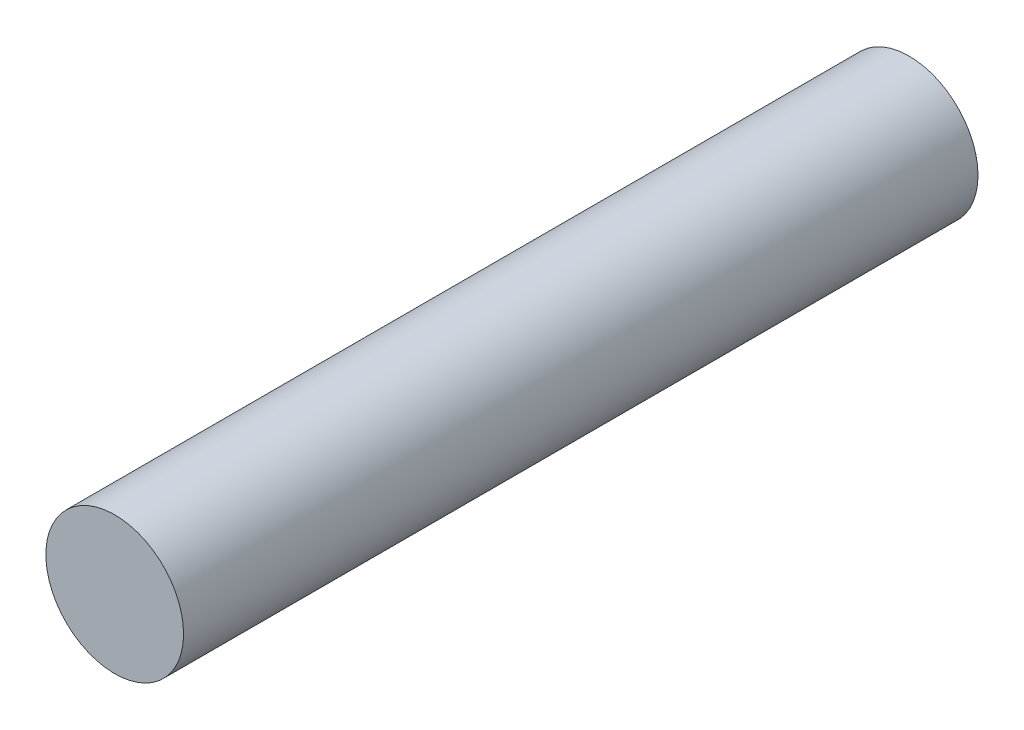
from build123d import *

# Parameters (mm, degrees)
ESQUISSE1_R          = 104
BASE_EXTRUSION_DEPTH = 1200


with BuildPart() as part:
    # Esquisse1 → Base-Extrusion (new body)
    with BuildSketch(Plane.XY):
        Circle(ESQUISSE1_R)
    extrude(amount=BASE_EXTRUSION_DEPTH)


solid = part.part
